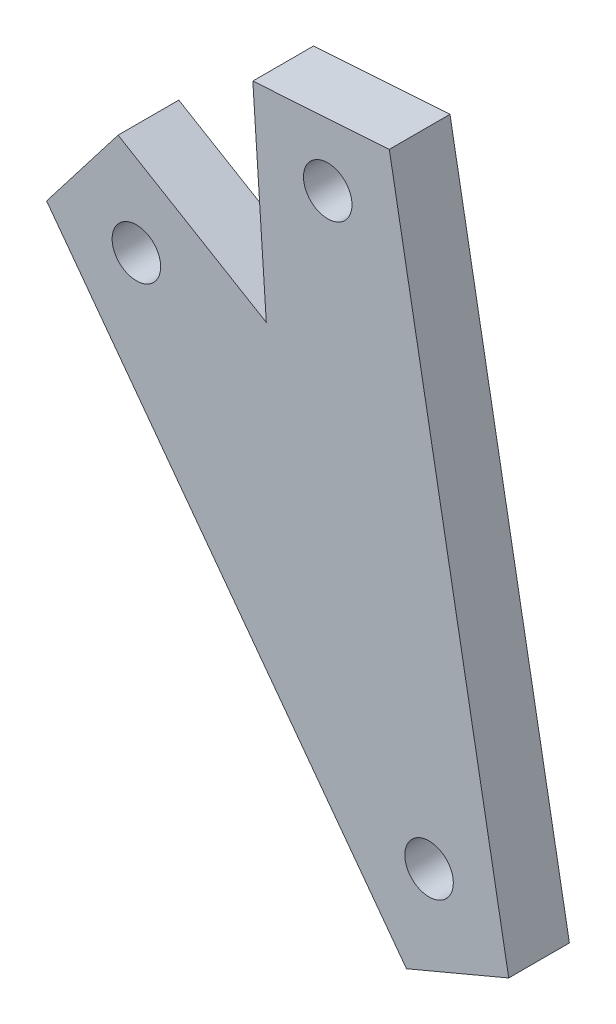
from build123d import *

# Parameters (mm, degrees)
SKETCH1_R           = 2.54
BOSS_EXTRUDE1_DEPTH = 6.35


with BuildPart() as part:
    # Sketch1 → Boss-Extrude1 (new body)
    with BuildSketch(Plane.XY):
        Polygon((-40.025891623, 40.528303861), (-2.361931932, -10.232281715), (8.338363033, -5.718435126), (-4.159090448, 63.137867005), (-18.44232294, 62.187024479), (-17.032645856, 41.011335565), (-32.541845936, 50.234477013), align=None)
        with Locations((-10.6059684, 56.157242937)):
            Circle(SKETCH1_R, mode=Mode.SUBTRACT)
        with Locations((-30.628362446, 40.528303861)):
            Circle(SKETCH1_R, mode=Mode.SUBTRACT)
        Circle(SKETCH1_R, mode=Mode.SUBTRACT)
    extrude(amount=BOSS_EXTRUDE1_DEPTH)


solid = part.part
